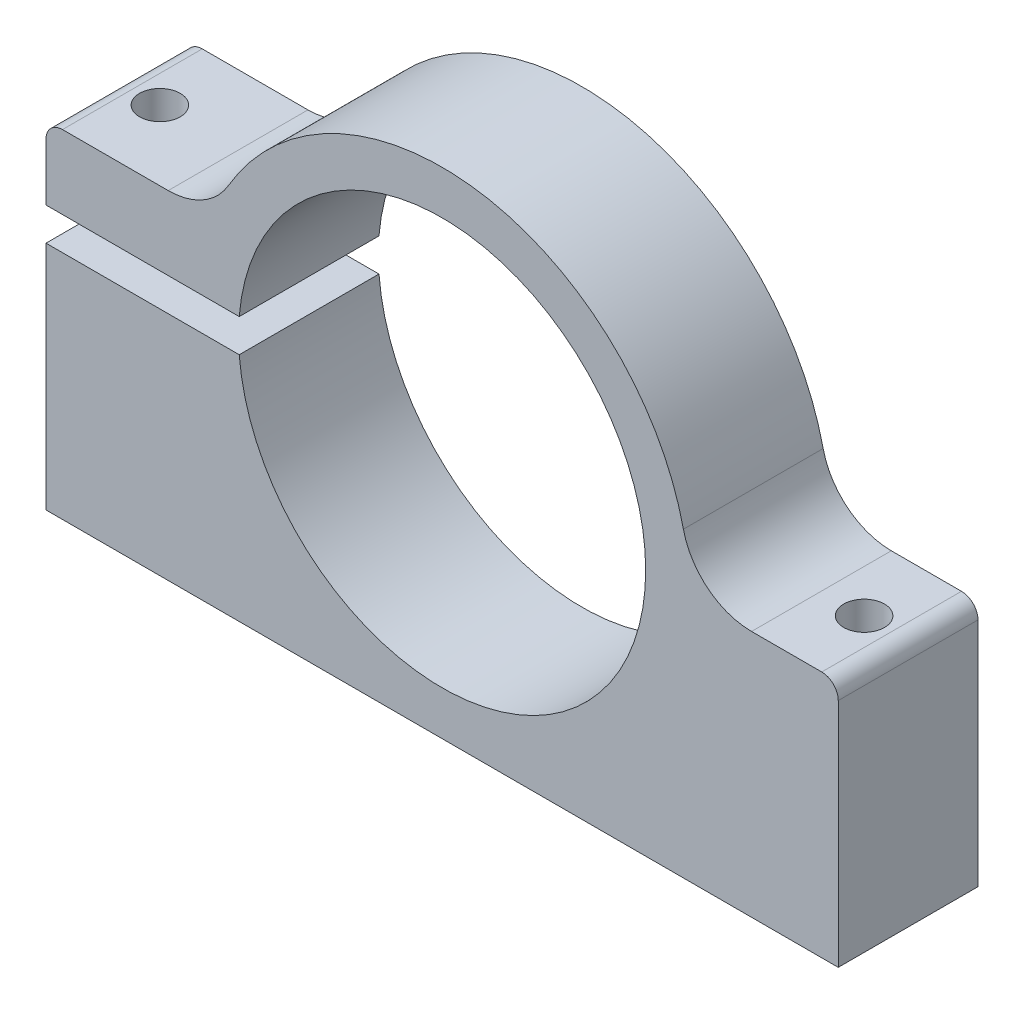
from build123d import *

# Parameters (mm, degrees)
EXTRUDE1_DEPTH     = 12.7
SKETCH2_R          = 18.5
CUT_EXTRUDE1_DEPTH = 45.311849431
SKETCH4_W          = 3.990810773
SKETCH4_H          = 3
CUT_EXTRUDE2_DEPTH = 45.311849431
SKETCH5_R          = 1.85
CUT_EXTRUDE3_DEPTH = 49.981920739
SKETCH6_R          = 1.85
CUT_EXTRUDE4_DEPTH = 45.311849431
FILLET2_R          = 6.35
FILLET3_R          = 6.35
FILLET6_R          = 1.5
FILLET7_R          = 1.5


with BuildPart() as part:
    # Sketch1 → Extrude1 (new body)
    with BuildSketch(Plane.XY):
        with BuildLine():
            Line((-22.429899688, -1.5), (-36, -1.5))
            Line((-36, -1.5), (-36, -22.5))
            Line((-36, -22.5), (36, -22.5))
            Line((36, -22.5), (36, 0))
            Line((36, 0), (22.48, 0))
            ThreePointArc((22.48, 0), (4.167763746, 22.090272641), (-20.93460368, 8.191017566))
            Line((-20.93460368, 8.191017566), (-36, 8.191017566))
            Line((-36, 8.191017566), (-36, 1.5))
            Line((-36, 1.5), (-22.429899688, 1.5))
            Line((-22.429899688, 1.5), (-22.429899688, -1.5))
        make_face()
    extrude(amount=-EXTRUDE1_DEPTH)

    # Sketch2 → Cut-Extrude1 (cut, through all)
    with BuildSketch(Plane.XY):
        Circle(SKETCH2_R)
    extrude(amount=-CUT_EXTRUDE1_DEPTH, mode=Mode.SUBTRACT)

    # Sketch4 → Cut-Extrude2 (cut, through all)
    with BuildSketch(Plane.XY):
        with Locations((-20.434494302, 0)):
            Rectangle(SKETCH4_W, SKETCH4_H)
    extrude(amount=-CUT_EXTRUDE2_DEPTH, mode=Mode.SUBTRACT)

    # Sketch5 → Cut-Extrude3 (cut, through all)
    with BuildSketch(Plane(origin=(0, 8.191017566, 0), x_dir=(1, 0, 0), z_dir=(0, 1, 0))):
        with Locations(Location((-32, 6.35, 0), (0, 0, 180))):
            Circle(SKETCH5_R)
    extrude(amount=-CUT_EXTRUDE3_DEPTH, mode=Mode.SUBTRACT)

    # Sketch6 → Cut-Extrude4 (cut, through all)
    with BuildSketch(Plane(origin=(0, 0, 0), x_dir=(1, 0, 0), z_dir=(0, 1, 0))):
        with Locations(Location((32, 6.35, 0), (0, 0, 180))):
            Circle(SKETCH6_R)
    extrude(amount=-CUT_EXTRUDE4_DEPTH, mode=Mode.SUBTRACT)

    # Fillet2
    fillet2_edges = [part.edges().sort_by_distance(p)[0] for p in [
        (22.48, 0, -6.35),
    ]]
    fillet(fillet2_edges, radius=FILLET2_R)

    # Fillet3
    fillet3_edges = [part.edges().sort_by_distance(p)[0] for p in [
        (-20.93460368, 8.191017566, -6.35),
    ]]
    fillet(fillet3_edges, radius=FILLET3_R)

    # Fillet6
    fillet6_edges = [part.edges().sort_by_distance(p)[0] for p in [
        (36, 0, -6.35),
    ]]
    fillet(fillet6_edges, radius=FILLET6_R)

    # Fillet7
    fillet7_edges = [part.edges().sort_by_distance(p)[0] for p in [
        (-36, 8.191017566, -6.35),
    ]]
    fillet(fillet7_edges, radius=FILLET7_R)


solid = part.part
